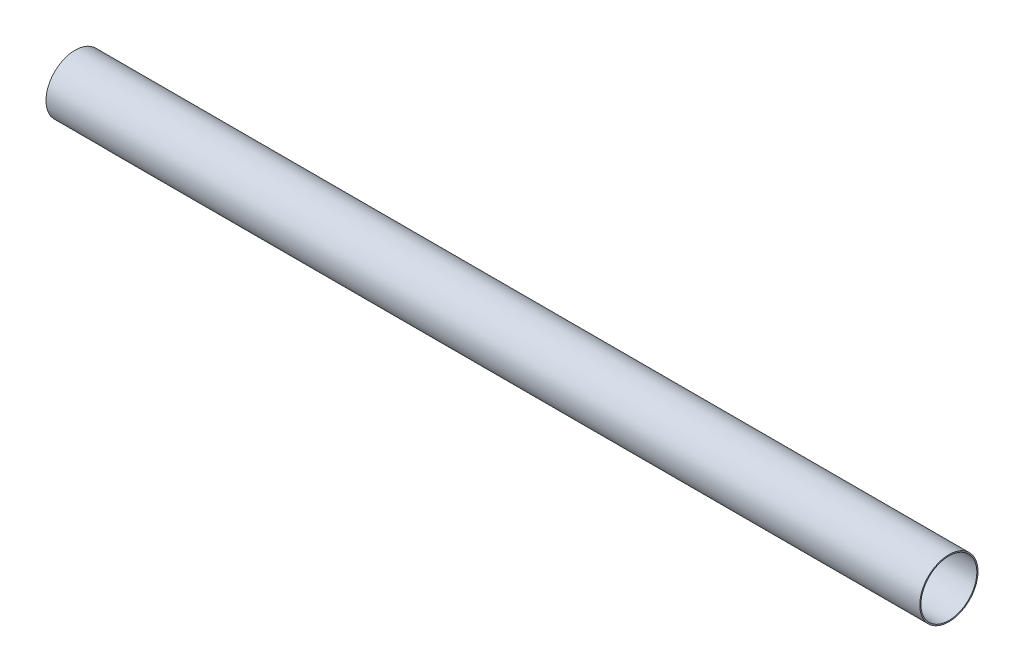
ISO-10303-21;
HEADER;
FILE_DESCRIPTION(('STEP AP214'),'2;1');
FILE_NAME('part.step','',(''),(''),'','','');
FILE_SCHEMA(('AUTOMOTIVE_DESIGN { 1 0 10303 214 1 1 1 1 }'));
ENDSEC;
DATA;
#1=APPLICATION_CONTEXT('core data for automotive mechanical design processes');
#2=APPLICATION_PROTOCOL_DEFINITION('international standard','automotive_design',2000,#1);
#3=PRODUCT_CONTEXT('',#1,'mechanical');
#4=PRODUCT('Part','Part','',(#3));
#5=PRODUCT_RELATED_PRODUCT_CATEGORY('part','',(#4));
#6=PRODUCT_DEFINITION_FORMATION('','',#4);
#7=PRODUCT_DEFINITION_CONTEXT('part definition',#1,'design');
#8=PRODUCT_DEFINITION('design','',#6,#7);
#9=PRODUCT_DEFINITION_SHAPE('','',#8);
#10=(LENGTH_UNIT() NAMED_UNIT(*) SI_UNIT(.MILLI.,.METRE.));
#11=(NAMED_UNIT(*) PLANE_ANGLE_UNIT() SI_UNIT($,.RADIAN.));
#12=(NAMED_UNIT(*) SI_UNIT($,.STERADIAN.) SOLID_ANGLE_UNIT());
#13=UNCERTAINTY_MEASURE_WITH_UNIT(LENGTH_MEASURE(1.E-05),#10,'distance_accuracy_value','');
#14=(GEOMETRIC_REPRESENTATION_CONTEXT(3) GLOBAL_UNCERTAINTY_ASSIGNED_CONTEXT((#13)) GLOBAL_UNIT_ASSIGNED_CONTEXT((#10,
#11,#12)) REPRESENTATION_CONTEXT('',''));
#15=CARTESIAN_POINT('',(0.,0.,0.));
#16=DIRECTION('',(0.,0.,1.));
#17=DIRECTION('',(1.,0.,0.));
#18=AXIS2_PLACEMENT_3D('',#15,#16,#17);
#19=CARTESIAN_POINT('',(900.,0.,0.));
#20=DIRECTION('',(-1.,0.,0.));
#21=DIRECTION('',(0.,0.,1.));
#22=AXIS2_PLACEMENT_3D('',#19,#20,#21);
#23=CYLINDRICAL_SURFACE('',#22,28.8);
#24=DIRECTION('',(-1.,0.,0.));
#25=VECTOR('',#24,1.);
#26=CARTESIAN_POINT('',(900.,-17.333205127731,23.));
#27=LINE('',#26,#25);
#28=CARTESIAN_POINT('',(50.,-17.333205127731,23.));
#29=VERTEX_POINT('',#28);
#30=CARTESIAN_POINT('',(0.,-17.333205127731,23.));
#31=VERTEX_POINT('',#30);
#32=EDGE_CURVE('E82',#29,#31,#27,.T.);
#33=ORIENTED_EDGE('',*,*,#32,.T.);
#34=CARTESIAN_POINT('',(0.,0.,0.));
#35=DIRECTION('',(-1.,0.,0.));
#36=DIRECTION('',(0.,1.,0.));
#37=AXIS2_PLACEMENT_3D('',#34,#35,#36);
#38=CIRCLE('',#37,28.8);
#39=CARTESIAN_POINT('',(0.,-17.333205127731,-23.));
#40=VERTEX_POINT('',#39);
#41=EDGE_CURVE('E76',#31,#40,#38,.T.);
#42=ORIENTED_EDGE('',*,*,#41,.T.);
#43=DIRECTION('',(-1.,0.,0.));
#44=VECTOR('',#43,1.);
#45=CARTESIAN_POINT('',(900.,-17.333205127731,-23.));
#46=LINE('',#45,#44);
#47=CARTESIAN_POINT('',(50.,-17.333205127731,-23.));
#48=VERTEX_POINT('',#47);
#49=EDGE_CURVE('E60',#40,#48,#46,.F.);
#50=ORIENTED_EDGE('',*,*,#49,.T.);
#51=CARTESIAN_POINT('',(50.,-17.333205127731,-23.));
#52=CARTESIAN_POINT('',(50.2186488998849,-17.3331927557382,-23.0000036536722));
#53=CARTESIAN_POINT('',(50.4372639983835,-17.3373443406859,-22.9968812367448));
#54=CARTESIAN_POINT('',(50.873981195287,-17.3538557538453,-22.9844262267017));
#55=CARTESIAN_POINT('',(51.0920833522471,-17.3662145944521,-22.9750943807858));
#56=CARTESIAN_POINT('',(51.7442027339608,-17.4153616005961,-22.9378937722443));
#57=CARTESIAN_POINT('',(52.1768684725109,-17.4642211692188,-22.9008195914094));
#58=CARTESIAN_POINT('',(53.0292346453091,-17.5909280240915,-22.8036278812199));
#59=CARTESIAN_POINT('',(53.4490309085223,-17.6683826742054,-22.7438221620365));
#60=CARTESIAN_POINT('',(54.2794171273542,-17.8490624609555,-22.6023032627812));
#61=CARTESIAN_POINT('',(54.6900024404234,-17.9523002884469,-22.5205792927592));
#62=CARTESIAN_POINT('',(55.6441570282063,-18.2213885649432,-22.3038215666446));
#63=CARTESIAN_POINT('',(56.183171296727,-18.3964545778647,-22.1601627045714));
#64=CARTESIAN_POINT('',(57.2392421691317,-18.7777459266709,-21.8380056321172));
#65=CARTESIAN_POINT('',(57.7562910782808,-18.9839820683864,-21.6594953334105));
#66=CARTESIAN_POINT('',(58.7714638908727,-19.4207920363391,-21.2687393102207));
#67=CARTESIAN_POINT('',(59.2694324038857,-19.6515241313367,-21.0562690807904));
#68=CARTESIAN_POINT('',(60.2428440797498,-20.1289853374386,-20.6003158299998));
#69=CARTESIAN_POINT('',(60.718287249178,-20.375714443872,-20.3568328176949));
#70=CARTESIAN_POINT('',(61.8125950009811,-20.9689474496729,-19.7479710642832));
#71=CARTESIAN_POINT('',(62.4222253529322,-21.3196875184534,-19.3700651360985));
#72=CARTESIAN_POINT('',(63.6013646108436,-22.027598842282,-18.5610931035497));
#73=CARTESIAN_POINT('',(64.1708593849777,-22.3847723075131,-18.1300084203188));
#74=CARTESIAN_POINT('',(65.267721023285,-23.0947837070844,-17.2164197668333));
#75=CARTESIAN_POINT('',(65.7951641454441,-23.4476284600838,-16.7340127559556));
#76=CARTESIAN_POINT('',(66.8067756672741,-24.140673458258,-15.7176978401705));
#77=CARTESIAN_POINT('',(67.2909583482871,-24.4808778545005,-15.1838070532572));
#78=CARTESIAN_POINT('',(68.1219845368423,-25.0754782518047,-14.1750720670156));
#79=CARTESIAN_POINT('',(68.4771206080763,-25.3336002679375,-13.7092376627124));
#80=CARTESIAN_POINT('',(69.1547513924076,-25.831991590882,-12.7452933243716));
#81=CARTESIAN_POINT('',(69.4772475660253,-26.0722616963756,-12.247184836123));
#82=CARTESIAN_POINT('',(70.0862836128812,-26.5303332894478,-11.2203885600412));
#83=CARTESIAN_POINT('',(70.3728618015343,-26.7481586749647,-10.6917342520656));
#84=CARTESIAN_POINT('',(70.9070709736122,-27.15724782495,-9.60523966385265));
#85=CARTESIAN_POINT('',(71.1547083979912,-27.348515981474,-9.04740423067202));
#86=CARTESIAN_POINT('',(71.5709354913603,-27.6718448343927,-7.99751135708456));
#87=CARTESIAN_POINT('',(71.7458326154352,-27.808479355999,-7.5093567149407));
#88=CARTESIAN_POINT('',(72.0636240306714,-28.0576865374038,-6.51674425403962));
#89=CARTESIAN_POINT('',(72.2065215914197,-28.1702616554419,-6.01228810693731));
#90=CARTESIAN_POINT('',(72.4583173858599,-28.3691745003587,-4.99008251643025));
#91=CARTESIAN_POINT('',(72.5672294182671,-28.4555228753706,-4.4723385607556));
#92=CARTESIAN_POINT('',(72.7494847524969,-28.6002794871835,-3.42673839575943));
#93=CARTESIAN_POINT('',(72.8228276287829,-28.6586873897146,-2.89888206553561));
#94=CARTESIAN_POINT('',(72.9329336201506,-28.746449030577,-1.83507144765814));
#95=CARTESIAN_POINT('',(72.9695678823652,-28.7757004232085,-1.2990952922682));
#96=CARTESIAN_POINT('',(73.0051736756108,-28.8041299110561,-0.225089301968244));
#97=CARTESIAN_POINT('',(73.0041451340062,-28.8033079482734,0.312940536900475));
#98=CARTESIAN_POINT('',(72.9644433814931,-28.7716095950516,1.38672705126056));
#99=CARTESIAN_POINT('',(72.9257690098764,-28.7407322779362,1.92248365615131));
#100=CARTESIAN_POINT('',(72.8114390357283,-28.6496170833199,2.98748581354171));
#101=CARTESIAN_POINT('',(72.7357842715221,-28.5893798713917,3.5167315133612));
#102=CARTESIAN_POINT('',(72.5538125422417,-28.4448867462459,4.53641966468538));
#103=CARTESIAN_POINT('',(72.4493784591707,-28.3621086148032,5.02741111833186));
#104=CARTESIAN_POINT('',(72.2099741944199,-28.1729935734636,5.99720772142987));
#105=CARTESIAN_POINT('',(72.075005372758,-28.0666577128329,6.47601341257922));
#106=CARTESIAN_POINT('',(71.7761686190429,-27.8322283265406,7.41911305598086));
#107=CARTESIAN_POINT('',(71.612295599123,-27.7041309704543,7.88340443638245));
#108=CARTESIAN_POINT('',(71.2574549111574,-27.4282144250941,8.79545916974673));
#109=CARTESIAN_POINT('',(71.0664856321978,-27.2803940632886,9.24322153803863));
#110=CARTESIAN_POINT('',(70.6395601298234,-26.9520140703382,10.1631675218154));
#111=CARTESIAN_POINT('',(70.4010390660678,-26.7696706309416,10.6335231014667));
#112=CARTESIAN_POINT('',(69.8958913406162,-26.3867269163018,11.5510976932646));
#113=CARTESIAN_POINT('',(69.6292631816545,-26.1861256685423,11.9983154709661));
#114=CARTESIAN_POINT('',(69.0699815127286,-25.769543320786,12.8687000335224));
#115=CARTESIAN_POINT('',(68.7773249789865,-25.5535604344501,13.2918640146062));
#116=CARTESIAN_POINT('',(68.1678339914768,-25.109096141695,14.1135228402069));
#117=CARTESIAN_POINT('',(67.8509962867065,-24.880613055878,14.5120143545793));
#118=CARTESIAN_POINT('',(67.127291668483,-24.3660959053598,15.3632297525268));
#119=CARTESIAN_POINT('',(66.7152984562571,-24.0778790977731,15.810284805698));
#120=CARTESIAN_POINT('',(65.860511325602,-23.4925253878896,16.6676556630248));
#121=CARTESIAN_POINT('',(65.4177124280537,-23.195387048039,17.0779655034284));
#122=CARTESIAN_POINT('',(64.5016892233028,-22.5968676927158,17.8624037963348));
#123=CARTESIAN_POINT('',(64.0283983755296,-22.2954786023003,18.2364483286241));
#124=CARTESIAN_POINT('',(63.0530078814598,-21.6950040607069,18.9468467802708));
#125=CARTESIAN_POINT('',(62.5509112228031,-21.3959183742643,19.283204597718));
#126=CARTESIAN_POINT('',(61.568859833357,-20.835842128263,19.8861740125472));
#127=CARTESIAN_POINT('',(61.0916033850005,-20.5740031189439,20.1563925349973));
#128=CARTESIAN_POINT('',(60.1133115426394,-20.0635216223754,20.6645773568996));
#129=CARTESIAN_POINT('',(59.6122752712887,-19.8148796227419,20.9025424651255));
#130=CARTESIAN_POINT('',(58.5892704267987,-19.3393826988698,21.3432117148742));
#131=CARTESIAN_POINT('',(58.0674527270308,-19.1124009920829,21.5461275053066));
#132=CARTESIAN_POINT('',(56.9999082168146,-18.6868763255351,21.9162083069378));
#133=CARTESIAN_POINT('',(56.454185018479,-18.4883290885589,22.0833786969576));
#134=CARTESIAN_POINT('',(55.4343182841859,-18.1598431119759,22.3539140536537));
#135=CARTESIAN_POINT('',(54.9636851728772,-18.0239799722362,22.4632889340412));
#136=CARTESIAN_POINT('',(54.0086472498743,-17.7847165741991,22.653196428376));
#137=CARTESIAN_POINT('',(53.5242524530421,-17.6812933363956,22.7337494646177));
#138=CARTESIAN_POINT('',(52.7859366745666,-17.5539523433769,22.8320308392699));
#139=CARTESIAN_POINT('',(52.535867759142,-17.5159520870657,22.8611705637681));
#140=CARTESIAN_POINT('',(52.0335474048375,-17.450311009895,22.9113151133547));
#141=CARTESIAN_POINT('',(51.7812960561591,-17.4226697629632,22.9323202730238));
#142=CARTESIAN_POINT('',(51.2746230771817,-17.3781727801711,22.9660605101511));
#143=CARTESIAN_POINT('',(51.0201974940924,-17.3613454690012,22.9787737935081));
#144=CARTESIAN_POINT('',(50.5105193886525,-17.3388432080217,22.9957507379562));
#145=CARTESIAN_POINT('',(50.2552666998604,-17.3331706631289,23.0000125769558));
#146=CARTESIAN_POINT('',(50.,-17.333205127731,23.));
#147=B_SPLINE_CURVE_WITH_KNOTS('',3,(#51,#52,#53,#54,#55,#56,#57,#58,#59,#60,#61,#62,#63,#64,
#65,#66,#67,#68,#69,#70,#71,#72,#73,#74,#75,#76,#77,#78,#79,#80,#81,#82,#83,#84,#85,#86,#87,#88,
#89,#90,#91,#92,#93,#94,#95,#96,#97,#98,#99,#100,#101,#102,#103,#104,#105,#106,#107,#108,#109,
#110,#111,#112,#113,#114,#115,#116,#117,#118,#119,#120,#121,#122,#123,#124,#125,#126,#127,#128,
#129,#130,#131,#132,#133,#134,#135,#136,#137,#138,#139,#140,#141,#142,#143,#144,#145,#146),
.UNSPECIFIED.,.F.,.F.,(4,2,2,2,2,2,2,2,2,2,2,2,2,2,2,2,2,2,2,2,2,2,2,2,2,2,2,2,2,2,2,2,2,2,2,2,
2,2,2,2,2,2,2,2,2,2,2,4),(0.,0.655819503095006,1.31156010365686,2.62054453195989,
3.91218617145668,5.20446483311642,6.9556678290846,8.70747931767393,10.4713911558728,
12.2353024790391,14.6274959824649,17.0205276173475,19.4091159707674,21.7969128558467,
23.7155436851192,25.6340886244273,27.5505692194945,29.4667324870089,31.073832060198,
32.6807673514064,34.2870493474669,35.8933505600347,37.5052705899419,39.1171937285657,
40.729166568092,42.3411028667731,43.8657243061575,45.3902778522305,46.9151000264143,
48.4400128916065,50.1124484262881,51.7849730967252,53.4576923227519,55.1306368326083,
57.1471450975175,59.1639800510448,61.1853759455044,63.2065625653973,65.0284572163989,
66.8504191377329,68.6609620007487,70.4712322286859,71.9752304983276,73.4781609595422,
74.2417067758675,75.0052211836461,75.7707343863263,76.5364126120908),.UNSPECIFIED.);
#148=EDGE_CURVE('E156',#48,#29,#147,.T.);
#149=ORIENTED_EDGE('',*,*,#148,.T.);
#150=EDGE_LOOP('',(#33,#42,#50,#149));
#151=FACE_BOUND('',#150,.T.);
#152=CARTESIAN_POINT('',(147.5,-28.1680670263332,-6.));
#153=CARTESIAN_POINT('',(147.333406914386,-28.1680650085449,-6.00000356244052));
#154=CARTESIAN_POINT('',(147.16685735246,-28.1695476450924,-5.99305998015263));
#155=CARTESIAN_POINT('',(146.834914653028,-28.1754295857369,-5.96534881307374));
#156=CARTESIAN_POINT('',(146.669521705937,-28.1798293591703,-5.94457900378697));
#157=CARTESIAN_POINT('',(146.341057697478,-28.1914203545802,-5.88936394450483));
#158=CARTESIAN_POINT('',(146.177987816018,-28.1986129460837,-5.8549119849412));
#159=CARTESIAN_POINT('',(145.855343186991,-28.2155796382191,-5.77259312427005));
#160=CARTESIAN_POINT('',(145.695769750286,-28.2253546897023,-5.72472128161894));
#161=CARTESIAN_POINT('',(145.381519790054,-28.2471842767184,-5.61601690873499));
#162=CARTESIAN_POINT('',(145.226836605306,-28.2592355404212,-5.55520296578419));
#163=CARTESIAN_POINT('',(144.923126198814,-28.2852855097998,-5.42100490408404));
#164=CARTESIAN_POINT('',(144.774101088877,-28.2992849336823,-5.34761614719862));
#165=CARTESIAN_POINT('',(144.482826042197,-28.3288254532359,-5.18884977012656));
#166=CARTESIAN_POINT('',(144.340573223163,-28.344365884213,-5.10347731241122));
#167=CARTESIAN_POINT('',(144.06365775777,-28.3765664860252,-4.9212835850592));
#168=CARTESIAN_POINT('',(143.928997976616,-28.3932270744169,-4.82445803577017));
#169=CARTESIAN_POINT('',(143.666454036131,-28.4274322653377,-4.6186703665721));
#170=CARTESIAN_POINT('',(143.53868486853,-28.4449857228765,-4.5095629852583));
#171=CARTESIAN_POINT('',(143.292710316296,-28.4802819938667,-4.2809941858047));
#172=CARTESIAN_POINT('',(143.174508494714,-28.4980248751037,-4.16152894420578));
#173=CARTESIAN_POINT('',(142.94855085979,-28.5331953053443,-3.91311809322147));
#174=CARTESIAN_POINT('',(142.840792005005,-28.5506229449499,-3.78417526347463));
#175=CARTESIAN_POINT('',(142.636382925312,-28.5846918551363,-3.51759183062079));
#176=CARTESIAN_POINT('',(142.539736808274,-28.6013328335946,-3.37994804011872));
#177=CARTESIAN_POINT('',(142.357448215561,-28.6335068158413,-3.09563161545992));
#178=CARTESIAN_POINT('',(142.271914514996,-28.6490282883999,-2.94888789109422));
#179=CARTESIAN_POINT('',(142.113502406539,-28.6783593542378,-2.64848882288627));
#180=CARTESIAN_POINT('',(142.040628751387,-28.6921683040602,-2.49483091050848));
#181=CARTESIAN_POINT('',(141.908162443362,-28.7176672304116,-2.18179008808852));
#182=CARTESIAN_POINT('',(141.84856382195,-28.7293581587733,-2.02240978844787));
#183=CARTESIAN_POINT('',(141.743059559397,-28.7502996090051,-1.6990070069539));
#184=CARTESIAN_POINT('',(141.697158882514,-28.7595492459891,-1.53498286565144));
#185=CARTESIAN_POINT('',(141.581782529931,-28.7829702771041,-1.04257340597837));
#186=CARTESIAN_POINT('',(141.53258084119,-28.7932219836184,-0.70897950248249));
#187=CARTESIAN_POINT('',(141.490710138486,-28.8019302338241,-0.0383096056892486));
#188=CARTESIAN_POINT('',(141.498035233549,-28.8003880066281,0.298766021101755));
#189=CARTESIAN_POINT('',(141.568330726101,-28.785822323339,0.961554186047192));
#190=CARTESIAN_POINT('',(141.630439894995,-28.7729765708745,1.28736181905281));
#191=CARTESIAN_POINT('',(141.807192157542,-28.7374429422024,1.9238135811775));
#192=CARTESIAN_POINT('',(141.921837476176,-28.7147546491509,2.2344570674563));
#193=CARTESIAN_POINT('',(142.201184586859,-28.6617967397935,2.8342070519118));
#194=CARTESIAN_POINT('',(142.366219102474,-28.6314769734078,3.12315398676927));
#195=CARTESIAN_POINT('',(142.741414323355,-28.5665904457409,3.66956885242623));
#196=CARTESIAN_POINT('',(142.95158063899,-28.5320231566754,3.9270328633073));
#197=CARTESIAN_POINT('',(143.415783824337,-28.4616816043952,4.40829210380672));
#198=CARTESIAN_POINT('',(143.670574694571,-28.4258968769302,4.63135912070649));
#199=CARTESIAN_POINT('',(144.214313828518,-28.3577698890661,5.03172468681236));
#200=CARTESIAN_POINT('',(144.50326285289,-28.3254277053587,5.20902221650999));
#201=CARTESIAN_POINT('',(145.108218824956,-28.2678239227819,5.51309841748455));
#202=CARTESIAN_POINT('',(145.424291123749,-28.2425800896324,5.63975066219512));
#203=CARTESIAN_POINT('',(146.073879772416,-28.2022851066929,5.83793172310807));
#204=CARTESIAN_POINT('',(146.407393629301,-28.1872325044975,5.90946839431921));
#205=CARTESIAN_POINT('',(147.075774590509,-28.1693175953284,5.99428146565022));
#206=CARTESIAN_POINT('',(147.410502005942,-28.1662344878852,6.00861326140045));
#207=CARTESIAN_POINT('',(148.077563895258,-28.1720136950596,5.98145728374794));
#208=CARTESIAN_POINT('',(148.409898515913,-28.1808752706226,5.93997296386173));
#209=CARTESIAN_POINT('',(149.059138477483,-28.2093378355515,5.80327480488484));
#210=CARTESIAN_POINT('',(149.376169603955,-28.2288245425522,5.70863240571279));
#211=CARTESIAN_POINT('',(149.989875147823,-28.2762402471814,5.46891890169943));
#212=CARTESIAN_POINT('',(150.286547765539,-28.3041699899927,5.32384334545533));
#213=CARTESIAN_POINT('',(150.855710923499,-28.3658160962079,4.98502078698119));
#214=CARTESIAN_POINT('',(151.127802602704,-28.3996083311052,4.7906178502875));
#215=CARTESIAN_POINT('',(151.635887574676,-28.4689672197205,4.35952503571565));
#216=CARTESIAN_POINT('',(151.871876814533,-28.504534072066,4.12283041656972));
#217=CARTESIAN_POINT('',(152.305101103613,-28.5741564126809,3.60912322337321));
#218=CARTESIAN_POINT('',(152.501619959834,-28.6081765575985,3.33150114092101));
#219=CARTESIAN_POINT('',(152.845225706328,-28.6702418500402,2.74655650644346));
#220=CARTESIAN_POINT('',(152.992314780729,-28.6982872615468,2.43923526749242));
#221=CARTESIAN_POINT('',(153.231866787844,-28.7450957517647,1.80549695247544));
#222=CARTESIAN_POINT('',(153.324656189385,-28.7639141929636,1.47920724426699));
#223=CARTESIAN_POINT('',(153.453984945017,-28.7903765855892,0.815049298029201));
#224=CARTESIAN_POINT('',(153.490531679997,-28.7980220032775,0.477182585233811));
#225=CARTESIAN_POINT('',(153.502249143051,-28.800471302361,-0.0270973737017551));
#226=CARTESIAN_POINT('',(153.499189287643,-28.7998302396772,-0.193262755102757));
#227=CARTESIAN_POINT('',(153.479312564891,-28.7956948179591,-0.524715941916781));
#228=CARTESIAN_POINT('',(153.462500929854,-28.7922015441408,-0.690004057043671));
#229=CARTESIAN_POINT('',(153.415240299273,-28.7824520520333,-1.01858112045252));
#230=CARTESIAN_POINT('',(153.384786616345,-28.7761948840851,-1.18186936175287));
#231=CARTESIAN_POINT('',(153.310498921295,-28.7610947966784,-1.50519152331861));
#232=CARTESIAN_POINT('',(153.266669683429,-28.7522527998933,-1.6652265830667));
#233=CARTESIAN_POINT('',(153.16608297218,-28.7322480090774,-1.9806158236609));
#234=CARTESIAN_POINT('',(153.109355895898,-28.7210906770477,-2.13598005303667));
#235=CARTESIAN_POINT('',(152.983363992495,-28.6967500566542,-2.44130795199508));
#236=CARTESIAN_POINT('',(152.914103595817,-28.6835674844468,-2.59127350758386));
#237=CARTESIAN_POINT('',(152.763501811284,-28.6555226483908,-2.88492433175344));
#238=CARTESIAN_POINT('',(152.682155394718,-28.6406596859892,-3.02860695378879));
#239=CARTESIAN_POINT('',(152.508004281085,-28.60966218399,-3.30863580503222));
#240=CARTESIAN_POINT('',(152.415203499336,-28.593528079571,-3.44498451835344));
#241=CARTESIAN_POINT('',(152.217006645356,-28.5601198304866,-3.71186788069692));
#242=CARTESIAN_POINT('',(152.111416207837,-28.5428305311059,-3.8422563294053));
#243=CARTESIAN_POINT('',(151.889760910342,-28.5078591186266,-4.09366267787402));
#244=CARTESIAN_POINT('',(151.773699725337,-28.4901771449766,-4.21468383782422));
#245=CARTESIAN_POINT('',(151.531779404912,-28.4548927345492,-4.44666804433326));
#246=CARTESIAN_POINT('',(151.405914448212,-28.4372903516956,-4.55762502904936));
#247=CARTESIAN_POINT('',(151.145335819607,-28.4026725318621,-4.76860783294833));
#248=CARTESIAN_POINT('',(151.010625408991,-28.3856568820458,-4.86863764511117));
#249=CARTESIAN_POINT('',(150.731504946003,-28.352481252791,-5.05827942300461));
#250=CARTESIAN_POINT('',(150.586996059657,-28.3363343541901,-5.14774829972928));
#251=CARTESIAN_POINT('',(150.290838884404,-28.305601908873,-5.3141375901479));
#252=CARTESIAN_POINT('',(150.139193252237,-28.2910157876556,-5.39106262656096));
#253=CARTESIAN_POINT('',(149.829854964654,-28.2638375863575,-5.53178314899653));
#254=CARTESIAN_POINT('',(149.672165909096,-28.2512443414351,-5.59558631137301));
#255=CARTESIAN_POINT('',(149.351839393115,-28.2284211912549,-5.70960635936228));
#256=CARTESIAN_POINT('',(149.189202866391,-28.2181908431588,-5.75982579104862));
#257=CARTESIAN_POINT('',(148.776406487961,-28.1958851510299,-5.86826926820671));
#258=CARTESIAN_POINT('',(148.523758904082,-28.1855130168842,-5.91759790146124));
#259=CARTESIAN_POINT('',(148.014039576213,-28.1716056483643,-5.98345985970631));
#260=CARTESIAN_POINT('',(147.756968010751,-28.1680701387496,-5.99999450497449));
#261=CARTESIAN_POINT('',(147.5,-28.1680670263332,-6.));
#262=B_SPLINE_CURVE_WITH_KNOTS('',3,(#152,#153,#154,#155,#156,#157,#158,#159,#160,#161,#162,
#163,#164,#165,#166,#167,#168,#169,#170,#171,#172,#173,#174,#175,#176,#177,#178,#179,#180,#181,
#182,#183,#184,#185,#186,#187,#188,#189,#190,#191,#192,#193,#194,#195,#196,#197,#198,#199,#200,
#201,#202,#203,#204,#205,#206,#207,#208,#209,#210,#211,#212,#213,#214,#215,#216,#217,#218,#219,
#220,#221,#222,#223,#224,#225,#226,#227,#228,#229,#230,#231,#232,#233,#234,#235,#236,#237,#238,
#239,#240,#241,#242,#243,#244,#245,#246,#247,#248,#249,#250,#251,#252,#253,#254,#255,#256,#257,
#258,#259,#260,#261),.UNSPECIFIED.,.T.,.F.,(4,2,2,2,2,2,2,2,2,2,2,2,2,2,2,2,2,2,2,2,2,2,2,2,2,2,
2,2,2,2,2,2,2,2,2,2,2,2,2,2,2,2,2,2,2,2,2,2,2,2,2,2,2,2,4),(0.,0.499553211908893,
0.999186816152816,1.49906573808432,1.99912897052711,2.49847880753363,2.99801322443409,
3.49733310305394,3.99684015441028,4.50304150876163,5.00943052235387,5.51567160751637,
6.0220992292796,6.53316067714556,7.04441357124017,7.55543613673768,8.06664367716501,
9.07336153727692,10.0799744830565,11.0710395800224,12.062146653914,13.0599450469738,
14.0578675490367,15.0746485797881,16.0914522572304,17.1107785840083,18.1299596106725,
19.1302479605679,20.1304744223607,21.1201489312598,22.109910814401,23.1135952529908,
24.1173922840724,25.138021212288,26.1586050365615,27.1729879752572,28.1872377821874,
28.685335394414,29.1832435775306,29.6813229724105,30.1792247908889,30.6759651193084,
31.1725301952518,31.6693024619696,32.1659053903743,32.6713249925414,33.1765678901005,
33.6821131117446,34.187472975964,34.6990415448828,35.2104211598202,35.7215007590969,
36.2324844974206,37.0030708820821,37.7736262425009),.UNSPECIFIED.);
#263=CARTESIAN_POINT('',(147.5,-28.1680670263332,-6.));
#264=VERTEX_POINT('',#263);
#265=EDGE_CURVE('E151',#264,#264,#262,.T.);
#266=ORIENTED_EDGE('',*,*,#265,.F.);
#267=EDGE_LOOP('',(#266));
#268=FACE_BOUND('',#267,.T.);
#269=CARTESIAN_POINT('',(87.5,-28.1680670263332,-6.));
#270=CARTESIAN_POINT('',(87.3334069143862,-28.1680650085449,-6.00000356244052));
#271=CARTESIAN_POINT('',(87.1668573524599,-28.1695476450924,-5.99305998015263));
#272=CARTESIAN_POINT('',(86.8349146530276,-28.1754295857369,-5.96534881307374));
#273=CARTESIAN_POINT('',(86.6695217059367,-28.1798293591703,-5.94457900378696));
#274=CARTESIAN_POINT('',(86.3410576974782,-28.1914203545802,-5.88936394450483));
#275=CARTESIAN_POINT('',(86.1779878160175,-28.1986129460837,-5.8549119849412));
#276=CARTESIAN_POINT('',(85.8553431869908,-28.2155796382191,-5.77259312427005));
#277=CARTESIAN_POINT('',(85.6957697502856,-28.2253546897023,-5.72472128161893));
#278=CARTESIAN_POINT('',(85.3815197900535,-28.2471842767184,-5.61601690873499));
#279=CARTESIAN_POINT('',(85.2268366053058,-28.2592355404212,-5.55520296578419));
#280=CARTESIAN_POINT('',(84.9231261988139,-28.2852855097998,-5.42100490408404));
#281=CARTESIAN_POINT('',(84.7741010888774,-28.2992849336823,-5.34761614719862));
#282=CARTESIAN_POINT('',(84.4828260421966,-28.3288254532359,-5.18884977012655));
#283=CARTESIAN_POINT('',(84.3405732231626,-28.344365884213,-5.10347731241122));
#284=CARTESIAN_POINT('',(84.0636577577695,-28.3765664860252,-4.9212835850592));
#285=CARTESIAN_POINT('',(83.9289979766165,-28.3932270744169,-4.82445803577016));
#286=CARTESIAN_POINT('',(83.6664540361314,-28.4274322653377,-4.6186703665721));
#287=CARTESIAN_POINT('',(83.5386848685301,-28.4449857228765,-4.50956298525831));
#288=CARTESIAN_POINT('',(83.2927103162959,-28.4802819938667,-4.28099418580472));
#289=CARTESIAN_POINT('',(83.1745084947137,-28.4980248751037,-4.16152894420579));
#290=CARTESIAN_POINT('',(82.9485508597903,-28.5331953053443,-3.91311809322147));
#291=CARTESIAN_POINT('',(82.8407920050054,-28.5506229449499,-3.78417526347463));
#292=CARTESIAN_POINT('',(82.6363829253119,-28.5846918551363,-3.51759183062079));
#293=CARTESIAN_POINT('',(82.5397368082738,-28.6013328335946,-3.37994804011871));
#294=CARTESIAN_POINT('',(82.3574482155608,-28.6335068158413,-3.09563161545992));
#295=CARTESIAN_POINT('',(82.271914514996,-28.6490282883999,-2.94888789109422));
#296=CARTESIAN_POINT('',(82.1135024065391,-28.6783593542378,-2.64848882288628));
#297=CARTESIAN_POINT('',(82.0406287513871,-28.6921683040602,-2.49483091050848));
#298=CARTESIAN_POINT('',(81.9081624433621,-28.7176672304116,-2.18179008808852));
#299=CARTESIAN_POINT('',(81.8485638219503,-28.7293581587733,-2.02240978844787));
#300=CARTESIAN_POINT('',(81.7430595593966,-28.7502996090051,-1.6990070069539));
#301=CARTESIAN_POINT('',(81.6971588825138,-28.7595492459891,-1.53498286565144));
#302=CARTESIAN_POINT('',(81.5817825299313,-28.7829702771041,-1.04257340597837));
#303=CARTESIAN_POINT('',(81.5325808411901,-28.7932219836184,-0.70897950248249));
#304=CARTESIAN_POINT('',(81.4907101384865,-28.8019302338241,-0.038309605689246));
#305=CARTESIAN_POINT('',(81.4980352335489,-28.8003880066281,0.298766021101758));
#306=CARTESIAN_POINT('',(81.5683307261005,-28.785822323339,0.961554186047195));
#307=CARTESIAN_POINT('',(81.630439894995,-28.7729765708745,1.28736181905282));
#308=CARTESIAN_POINT('',(81.8071921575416,-28.7374429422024,1.9238135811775));
#309=CARTESIAN_POINT('',(81.921837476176,-28.7147546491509,2.23445706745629));
#310=CARTESIAN_POINT('',(82.2011845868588,-28.6617967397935,2.8342070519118));
#311=CARTESIAN_POINT('',(82.3662191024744,-28.6314769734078,3.12315398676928));
#312=CARTESIAN_POINT('',(82.7414143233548,-28.5665904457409,3.66956885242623));
#313=CARTESIAN_POINT('',(82.9515806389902,-28.5320231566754,3.9270328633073));
#314=CARTESIAN_POINT('',(83.4157838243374,-28.4616816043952,4.40829210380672));
#315=CARTESIAN_POINT('',(83.6705746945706,-28.4258968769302,4.6313591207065));
#316=CARTESIAN_POINT('',(84.2143138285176,-28.3577698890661,5.03172468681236));
#317=CARTESIAN_POINT('',(84.5032628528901,-28.3254277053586,5.20902221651));
#318=CARTESIAN_POINT('',(85.1082188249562,-28.2678239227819,5.51309841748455));
#319=CARTESIAN_POINT('',(85.4242911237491,-28.2425800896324,5.63975066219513));
#320=CARTESIAN_POINT('',(86.0738797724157,-28.2022851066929,5.83793172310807));
#321=CARTESIAN_POINT('',(86.4073936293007,-28.1872325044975,5.90946839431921));
#322=CARTESIAN_POINT('',(87.0757745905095,-28.1693175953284,5.99428146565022));
#323=CARTESIAN_POINT('',(87.4105020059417,-28.1662344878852,6.00861326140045));
#324=CARTESIAN_POINT('',(88.077563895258,-28.1720136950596,5.98145728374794));
#325=CARTESIAN_POINT('',(88.4098985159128,-28.1808752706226,5.93997296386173));
#326=CARTESIAN_POINT('',(89.0591384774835,-28.2093378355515,5.80327480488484));
#327=CARTESIAN_POINT('',(89.3761696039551,-28.2288245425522,5.70863240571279));
#328=CARTESIAN_POINT('',(89.9898751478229,-28.2762402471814,5.46891890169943));
#329=CARTESIAN_POINT('',(90.286547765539,-28.3041699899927,5.32384334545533));
#330=CARTESIAN_POINT('',(90.8557109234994,-28.3658160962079,4.98502078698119));
#331=CARTESIAN_POINT('',(91.1278026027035,-28.3996083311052,4.79061785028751));
#332=CARTESIAN_POINT('',(91.635887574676,-28.4689672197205,4.35952503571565));
#333=CARTESIAN_POINT('',(91.8718768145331,-28.504534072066,4.12283041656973));
#334=CARTESIAN_POINT('',(92.3051011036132,-28.5741564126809,3.60912322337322));
#335=CARTESIAN_POINT('',(92.5016199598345,-28.6081765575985,3.33150114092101));
#336=CARTESIAN_POINT('',(92.8452257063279,-28.6702418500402,2.74655650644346));
#337=CARTESIAN_POINT('',(92.9923147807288,-28.6982872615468,2.43923526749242));
#338=CARTESIAN_POINT('',(93.2318667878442,-28.7450957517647,1.80549695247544));
#339=CARTESIAN_POINT('',(93.324656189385,-28.7639141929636,1.47920724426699));
#340=CARTESIAN_POINT('',(93.4539849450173,-28.7903765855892,0.815049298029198));
#341=CARTESIAN_POINT('',(93.4905316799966,-28.7980220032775,0.477182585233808));
#342=CARTESIAN_POINT('',(93.5022491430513,-28.800471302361,-0.0270973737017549));
#343=CARTESIAN_POINT('',(93.4991892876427,-28.7998302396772,-0.193262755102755));
#344=CARTESIAN_POINT('',(93.4793125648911,-28.7956948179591,-0.524715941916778));
#345=CARTESIAN_POINT('',(93.4625009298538,-28.7922015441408,-0.69000405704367));
#346=CARTESIAN_POINT('',(93.4152402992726,-28.7824520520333,-1.01858112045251));
#347=CARTESIAN_POINT('',(93.3847866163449,-28.7761948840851,-1.18186936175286));
#348=CARTESIAN_POINT('',(93.3104989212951,-28.7610947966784,-1.50519152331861));
#349=CARTESIAN_POINT('',(93.2666696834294,-28.7522527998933,-1.6652265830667));
#350=CARTESIAN_POINT('',(93.1660829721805,-28.7322480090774,-1.98061582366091));
#351=CARTESIAN_POINT('',(93.1093558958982,-28.7210906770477,-2.13598005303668));
#352=CARTESIAN_POINT('',(92.9833639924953,-28.6967500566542,-2.44130795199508));
#353=CARTESIAN_POINT('',(92.9141035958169,-28.6835674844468,-2.59127350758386));
#354=CARTESIAN_POINT('',(92.7635018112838,-28.6555226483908,-2.88492433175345));
#355=CARTESIAN_POINT('',(92.6821553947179,-28.6406596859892,-3.02860695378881));
#356=CARTESIAN_POINT('',(92.5080042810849,-28.60966218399,-3.30863580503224));
#357=CARTESIAN_POINT('',(92.415203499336,-28.593528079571,-3.44498451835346));
#358=CARTESIAN_POINT('',(92.2170066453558,-28.5601198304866,-3.71186788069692));
#359=CARTESIAN_POINT('',(92.1114162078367,-28.5428305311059,-3.8422563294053));
#360=CARTESIAN_POINT('',(91.889760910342,-28.5078591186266,-4.09366267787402));
#361=CARTESIAN_POINT('',(91.7736997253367,-28.4901771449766,-4.21468383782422));
#362=CARTESIAN_POINT('',(91.5317794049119,-28.4548927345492,-4.44666804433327));
#363=CARTESIAN_POINT('',(91.4059144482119,-28.4372903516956,-4.55762502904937));
#364=CARTESIAN_POINT('',(91.1453358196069,-28.4026725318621,-4.76860783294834));
#365=CARTESIAN_POINT('',(91.0106254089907,-28.3856568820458,-4.86863764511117));
#366=CARTESIAN_POINT('',(90.7315049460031,-28.352481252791,-5.05827942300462));
#367=CARTESIAN_POINT('',(90.5869960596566,-28.3363343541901,-5.14774829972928));
#368=CARTESIAN_POINT('',(90.2908388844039,-28.305601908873,-5.3141375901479));
#369=CARTESIAN_POINT('',(90.1391932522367,-28.2910157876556,-5.39106262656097));
#370=CARTESIAN_POINT('',(89.8298549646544,-28.2638375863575,-5.53178314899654));
#371=CARTESIAN_POINT('',(89.6721659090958,-28.2512443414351,-5.59558631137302));
#372=CARTESIAN_POINT('',(89.3518393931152,-28.2284211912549,-5.70960635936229));
#373=CARTESIAN_POINT('',(89.1892028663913,-28.2181908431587,-5.75982579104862));
#374=CARTESIAN_POINT('',(88.7764064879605,-28.1958851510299,-5.8682692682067));
#375=CARTESIAN_POINT('',(88.5237589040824,-28.1855130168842,-5.91759790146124));
#376=CARTESIAN_POINT('',(88.0140395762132,-28.1716056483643,-5.98345985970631));
#377=CARTESIAN_POINT('',(87.7569680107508,-28.1680701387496,-5.99999450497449));
#378=CARTESIAN_POINT('',(87.5,-28.1680670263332,-6.));
#379=B_SPLINE_CURVE_WITH_KNOTS('',3,(#269,#270,#271,#272,#273,#274,#275,#276,#277,#278,#279,
#280,#281,#282,#283,#284,#285,#286,#287,#288,#289,#290,#291,#292,#293,#294,#295,#296,#297,#298,
#299,#300,#301,#302,#303,#304,#305,#306,#307,#308,#309,#310,#311,#312,#313,#314,#315,#316,#317,
#318,#319,#320,#321,#322,#323,#324,#325,#326,#327,#328,#329,#330,#331,#332,#333,#334,#335,#336,
#337,#338,#339,#340,#341,#342,#343,#344,#345,#346,#347,#348,#349,#350,#351,#352,#353,#354,#355,
#356,#357,#358,#359,#360,#361,#362,#363,#364,#365,#366,#367,#368,#369,#370,#371,#372,#373,#374,
#375,#376,#377,#378),.UNSPECIFIED.,.T.,.F.,(4,2,2,2,2,2,2,2,2,2,2,2,2,2,2,2,2,2,2,2,2,2,2,2,2,2,
2,2,2,2,2,2,2,2,2,2,2,2,2,2,2,2,2,2,2,2,2,2,2,2,2,2,2,2,4),(0.,0.499553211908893,
0.999186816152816,1.49906573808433,1.99912897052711,2.49847880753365,2.99801322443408,
3.49733310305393,3.99684015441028,4.5030415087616,5.00943052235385,5.51567160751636,
6.0220992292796,6.53316067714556,7.04441357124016,7.55543613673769,8.06664367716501,
9.07336153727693,10.0799744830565,11.0710395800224,12.062146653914,13.0599450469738,
14.0578675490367,15.0746485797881,16.0914522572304,17.1107785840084,18.1299596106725,
19.130247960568,20.1304744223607,21.1201489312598,22.109910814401,23.1135952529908,
24.1173922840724,25.138021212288,26.1586050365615,27.1729879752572,28.1872377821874,
28.685335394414,29.1832435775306,29.6813229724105,30.1792247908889,30.6759651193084,
31.1725301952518,31.6693024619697,32.1659053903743,32.6713249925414,33.1765678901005,
33.6821131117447,34.187472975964,34.6990415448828,35.2104211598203,35.7215007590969,
36.2324844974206,37.0030708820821,37.7736262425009),.UNSPECIFIED.);
#380=CARTESIAN_POINT('',(87.5,-28.1680670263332,-6.));
#381=VERTEX_POINT('',#380);
#382=EDGE_CURVE('E92',#381,#381,#379,.T.);
#383=ORIENTED_EDGE('',*,*,#382,.F.);
#384=EDGE_LOOP('',(#383));
#385=FACE_BOUND('',#384,.T.);
#386=CARTESIAN_POINT('',(900.,0.,0.));
#387=DIRECTION('',(-1.,0.,0.));
#388=DIRECTION('',(0.,1.,0.));
#389=AXIS2_PLACEMENT_3D('',#386,#387,#388);
#390=CIRCLE('',#389,28.8);
#391=CARTESIAN_POINT('',(900.,28.8,0.));
#392=VERTEX_POINT('',#391);
#393=EDGE_CURVE('E90',#392,#392,#390,.T.);
#394=ORIENTED_EDGE('',*,*,#393,.F.);
#395=EDGE_LOOP('',(#394));
#396=FACE_BOUND('',#395,.T.);
#397=ADVANCED_FACE('F14',(#151,#268,#385,#396),#23,.F.);
#398=CARTESIAN_POINT('',(900.,0.,0.));
#399=DIRECTION('',(-1.,0.,0.));
#400=DIRECTION('',(0.,0.,1.));
#401=AXIS2_PLACEMENT_3D('',#398,#399,#400);
#402=CYLINDRICAL_SURFACE('',#401,30.);
#403=CARTESIAN_POINT('',(0.,0.,0.));
#404=DIRECTION('',(-1.,0.,0.));
#405=DIRECTION('',(0.,1.,0.));
#406=AXIS2_PLACEMENT_3D('',#403,#404,#405);
#407=CIRCLE('',#406,30.);
#408=CARTESIAN_POINT('',(0.,-19.2613602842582,23.));
#409=VERTEX_POINT('',#408);
#410=CARTESIAN_POINT('',(0.,-19.2613602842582,-23.));
#411=VERTEX_POINT('',#410);
#412=EDGE_CURVE('E40',#409,#411,#407,.T.);
#413=ORIENTED_EDGE('',*,*,#412,.F.);
#414=DIRECTION('',(-1.,0.,0.));
#415=VECTOR('',#414,1.);
#416=CARTESIAN_POINT('',(900.,-19.2613602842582,23.));
#417=LINE('',#416,#415);
#418=CARTESIAN_POINT('',(50.,-19.2613602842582,23.));
#419=VERTEX_POINT('',#418);
#420=EDGE_CURVE('E70',#419,#409,#417,.T.);
#421=ORIENTED_EDGE('',*,*,#420,.F.);
#422=CARTESIAN_POINT('',(50.,-19.2613602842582,-23.));
#423=CARTESIAN_POINT('',(50.2685918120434,-19.2613276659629,-23.0000128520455));
#424=CARTESIAN_POINT('',(50.5371703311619,-19.2669775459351,-22.995295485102));
#425=CARTESIAN_POINT('',(51.0734848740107,-19.2893994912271,-22.9764979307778));
#426=CARTESIAN_POINT('',(51.3412210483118,-19.3061694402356,-22.9624195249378));
#427=CARTESIAN_POINT('',(51.8745028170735,-19.3505360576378,-22.9250419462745));
#428=CARTESIAN_POINT('',(52.1400521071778,-19.3781068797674,-22.9017647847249));
#429=CARTESIAN_POINT('',(52.6688984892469,-19.4436139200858,-22.8461749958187));
#430=CARTESIAN_POINT('',(52.9321954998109,-19.4815505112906,-22.813862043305));
#431=CARTESIAN_POINT('',(53.7102199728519,-19.6088470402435,-22.7047491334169));
#432=CARTESIAN_POINT('',(54.2209469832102,-19.7123800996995,-22.615210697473));
#433=CARTESIAN_POINT('',(55.2279100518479,-19.9522250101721,-22.4038863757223));
#434=CARTESIAN_POINT('',(55.7241363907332,-20.0885583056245,-22.2820793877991));
#435=CARTESIAN_POINT('',(56.8070561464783,-20.4209512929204,-21.9783044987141));
#436=CARTESIAN_POINT('',(57.3896793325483,-20.6235523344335,-21.7889989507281));
#437=CARTESIAN_POINT('',(58.5282385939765,-21.0583395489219,-21.3690812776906));
#438=CARTESIAN_POINT('',(59.0841691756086,-21.2905317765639,-21.1384606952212));
#439=CARTESIAN_POINT('',(60.1720195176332,-21.7768665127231,-20.6371207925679));
#440=CARTESIAN_POINT('',(60.703782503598,-22.031127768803,-20.3661781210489));
#441=CARTESIAN_POINT('',(61.7398013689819,-22.5526636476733,-19.7870974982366));
#442=CARTESIAN_POINT('',(62.2440592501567,-22.8199373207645,-19.4789622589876));
#443=CARTESIAN_POINT('',(63.2363767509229,-23.3672094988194,-18.8191782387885));
#444=CARTESIAN_POINT('',(63.723793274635,-23.647359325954,-18.4666888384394));
#445=CARTESIAN_POINT('',(64.6693393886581,-24.2083611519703,-17.7248850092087));
#446=CARTESIAN_POINT('',(65.1274680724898,-24.4892131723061,-17.3355694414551));
#447=CARTESIAN_POINT('',(66.0126172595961,-25.0456726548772,-16.5214104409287));
#448=CARTESIAN_POINT('',(66.4396914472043,-25.3212885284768,-16.0966311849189));
#449=CARTESIAN_POINT('',(67.2619857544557,-25.862723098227,-15.2114660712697));
#450=CARTESIAN_POINT('',(67.6572077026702,-26.1285423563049,-14.7510822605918));
#451=CARTESIAN_POINT('',(68.397561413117,-26.6345719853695,-13.8155817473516));
#452=CARTESIAN_POINT('',(68.7441052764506,-26.8753900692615,-13.3419134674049));
#453=CARTESIAN_POINT('',(69.4034818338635,-27.3393533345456,-12.3633699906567));
#454=CARTESIAN_POINT('',(69.716314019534,-27.5624982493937,-11.8584943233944));
#455=CARTESIAN_POINT('',(70.3052090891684,-27.986779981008,-10.8191970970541));
#456=CARTESIAN_POINT('',(70.581288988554,-28.187926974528,-10.2847893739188));
#457=CARTESIAN_POINT('',(71.0935928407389,-28.5641282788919,-9.18837740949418));
#458=CARTESIAN_POINT('',(71.3298234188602,-28.7391869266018,-8.62637777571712));
#459=CARTESIAN_POINT('',(71.7268850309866,-29.0351990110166,-7.56399870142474));
#460=CARTESIAN_POINT('',(71.8937106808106,-29.1603293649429,-7.06701821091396));
#461=CARTESIAN_POINT('',(72.1941546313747,-29.3865737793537,-6.05777253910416));
#462=CARTESIAN_POINT('',(72.3277760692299,-29.4876901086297,-5.54550880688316));
#463=CARTESIAN_POINT('',(72.5599478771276,-29.6638758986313,-4.50895483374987));
#464=CARTESIAN_POINT('',(72.658516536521,-29.7389589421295,-3.98467101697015));
#465=CARTESIAN_POINT('',(72.8192165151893,-29.8615796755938,-2.9273327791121));
#466=CARTESIAN_POINT('',(72.8813474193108,-29.9091170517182,-2.39427825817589));
#467=CARTESIAN_POINT('',(72.9683059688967,-29.9756950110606,-1.32180657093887));
#468=CARTESIAN_POINT('',(72.9930262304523,-29.9946535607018,-0.782375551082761));
#469=CARTESIAN_POINT('',(73.0044142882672,-30.0033841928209,0.297127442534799));
#470=CARTESIAN_POINT('',(72.99108200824,-29.9931562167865,0.837199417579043));
#471=CARTESIAN_POINT('',(72.9265834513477,-29.9437439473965,1.91380017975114));
#472=CARTESIAN_POINT('',(72.875412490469,-29.9045560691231,2.45032851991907));
#473=CARTESIAN_POINT('',(72.7360597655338,-29.798093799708,3.51570857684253));
#474=CARTESIAN_POINT('',(72.64787848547,-29.7308197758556,4.04456039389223));
#475=CARTESIAN_POINT('',(72.4403189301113,-29.5730210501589,5.06888855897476));
#476=CARTESIAN_POINT('',(72.3224074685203,-29.4835922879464,5.56483349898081));
#477=CARTESIAN_POINT('',(72.0553923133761,-29.2819513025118,6.54346475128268));
#478=CARTESIAN_POINT('',(71.9062897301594,-29.169739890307,7.02615153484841));
#479=CARTESIAN_POINT('',(71.5786002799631,-28.9244565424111,7.97599300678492));
#480=CARTESIAN_POINT('',(71.4000097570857,-28.7913820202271,8.44314576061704));
#481=CARTESIAN_POINT('',(71.0151744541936,-28.5065049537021,9.36000419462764));
#482=CARTESIAN_POINT('',(70.8089280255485,-28.3547012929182,9.80970883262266));
#483=CARTESIAN_POINT('',(70.3474764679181,-28.0177155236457,10.7366547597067));
#484=CARTESIAN_POINT('',(70.0894022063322,-27.8307017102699,11.2118012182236));
#485=CARTESIAN_POINT('',(69.5439880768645,-27.4395943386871,12.1375965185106));
#486=CARTESIAN_POINT('',(69.2566464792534,-27.2354997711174,12.5882439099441));
#487=CARTESIAN_POINT('',(68.6546454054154,-26.8132379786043,13.4642789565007));
#488=CARTESIAN_POINT('',(68.3399734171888,-26.5950643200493,13.8896548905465));
#489=CARTESIAN_POINT('',(67.6852147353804,-26.1478421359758,14.7142927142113));
#490=CARTESIAN_POINT('',(67.345126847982,-25.9187930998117,15.1135533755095));
#491=CARTESIAN_POINT('',(66.570308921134,-25.406190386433,15.9630330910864));
#492=CARTESIAN_POINT('',(66.130282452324,-25.1209232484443,16.4073987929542));
#493=CARTESIAN_POINT('',(65.217525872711,-24.5448102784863,17.2573440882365));
#494=CARTESIAN_POINT('',(64.7447897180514,-24.2539634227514,17.6629164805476));
#495=CARTESIAN_POINT('',(63.7671294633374,-23.672329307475,18.435150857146));
#496=CARTESIAN_POINT('',(63.2621592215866,-23.381542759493,18.8017549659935));
#497=CARTESIAN_POINT('',(62.2212712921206,-22.8072570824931,19.4943906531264));
#498=CARTESIAN_POINT('',(61.6853594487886,-22.523756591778,19.820429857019));
#499=CARTESIAN_POINT('',(60.6779035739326,-22.0195782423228,20.3777831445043));
#500=CARTESIAN_POINT('',(60.2112239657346,-21.7965055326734,20.6157324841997));
#501=CARTESIAN_POINT('',(59.2566761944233,-21.3659681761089,21.061609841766));
#502=CARTESIAN_POINT('',(58.7688077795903,-21.1585037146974,21.2695375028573));
#503=CARTESIAN_POINT('',(57.7746896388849,-20.7662777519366,21.6526327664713));
#504=CARTESIAN_POINT('',(57.2685460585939,-20.5814061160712,21.8279616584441));
#505=CARTESIAN_POINT('',(56.2364813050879,-20.2399824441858,22.1449190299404));
#506=CARTESIAN_POINT('',(55.7105654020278,-20.0834229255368,22.2865564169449));
#507=CARTESIAN_POINT('',(54.7625978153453,-19.8374160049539,22.5055007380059));
#508=CARTESIAN_POINT('',(54.344090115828,-19.74080213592,22.5901122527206));
#509=CARTESIAN_POINT('',(53.4983312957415,-19.5720910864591,22.7364409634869));
#510=CARTESIAN_POINT('',(53.0710836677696,-19.4999843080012,22.7981671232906));
#511=CARTESIAN_POINT('',(52.2052781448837,-19.3824021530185,22.8982225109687));
#512=CARTESIAN_POINT('',(51.7666476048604,-19.3372274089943,22.9362878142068));
#513=CARTESIAN_POINT('',(51.1058882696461,-19.2918242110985,22.9744610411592));
#514=CARTESIAN_POINT('',(50.8849956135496,-19.280416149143,22.9840313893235));
#515=CARTESIAN_POINT('',(50.4427455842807,-19.2651788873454,22.9968026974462));
#516=CARTESIAN_POINT('',(50.221388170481,-19.2613503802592,23.0000030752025));
#517=CARTESIAN_POINT('',(50.,-19.2613602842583,23.));
#518=B_SPLINE_CURVE_WITH_KNOTS('',3,(#422,#423,#424,#425,#426,#427,#428,#429,#430,#431,#432,
#433,#434,#435,#436,#437,#438,#439,#440,#441,#442,#443,#444,#445,#446,#447,#448,#449,#450,#451,
#452,#453,#454,#455,#456,#457,#458,#459,#460,#461,#462,#463,#464,#465,#466,#467,#468,#469,#470,
#471,#472,#473,#474,#475,#476,#477,#478,#479,#480,#481,#482,#483,#484,#485,#486,#487,#488,#489,
#490,#491,#492,#493,#494,#495,#496,#497,#498,#499,#500,#501,#502,#503,#504,#505,#506,#507,#508,
#509,#510,#511,#512,#513,#514,#515,#516,#517),.UNSPECIFIED.,.F.,.F.,(4,2,2,2,2,2,2,2,2,2,2,2,2,
2,2,2,2,2,2,2,2,2,2,2,2,2,2,2,2,2,2,2,2,2,2,2,2,2,2,2,2,2,2,2,2,2,2,4),(0.,0.80565240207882,
1.61115152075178,2.4147347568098,3.21834691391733,4.80193302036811,6.38655728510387,
8.31924834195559,10.2523354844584,12.196558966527,14.1406407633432,16.1296229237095,
18.1186666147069,20.1041857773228,22.0895908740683,23.9909593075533,25.8923564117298,
27.7928701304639,29.6930675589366,31.3082888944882,32.9233575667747,34.5375823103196,
36.1518254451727,37.7706933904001,39.3895645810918,41.0086362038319,42.6276866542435,
44.178695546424,45.7296492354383,47.2807953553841,48.8320339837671,50.5468043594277,
52.2616761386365,53.9773371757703,55.6930788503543,57.753142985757,59.813588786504,
61.8770532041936,63.9401291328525,65.6469628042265,67.3538167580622,69.0519868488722,
70.7497074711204,72.0617783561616,73.373334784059,74.6992700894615,75.3632577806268,
76.0273061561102),.UNSPECIFIED.);
#519=CARTESIAN_POINT('',(50.,-19.2613602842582,-23.));
#520=VERTEX_POINT('',#519);
#521=EDGE_CURVE('E9',#520,#419,#518,.T.);
#522=ORIENTED_EDGE('',*,*,#521,.F.);
#523=DIRECTION('',(-1.,0.,0.));
#524=VECTOR('',#523,1.);
#525=CARTESIAN_POINT('',(900.,-19.2613602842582,-23.));
#526=LINE('',#525,#524);
#527=EDGE_CURVE('E71',#411,#520,#526,.F.);
#528=ORIENTED_EDGE('',*,*,#527,.F.);
#529=EDGE_LOOP('',(#413,#421,#522,#528));
#530=FACE_BOUND('',#529,.T.);
#531=CARTESIAN_POINT('',(147.5,-29.3938769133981,-6.));
#532=CARTESIAN_POINT('',(147.333250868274,-29.393875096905,-6.00000333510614));
#533=CARTESIAN_POINT('',(147.166543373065,-29.3952984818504,-5.99304686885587));
#534=CARTESIAN_POINT('',(146.834283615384,-29.4009458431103,-5.96528300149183));
#535=CARTESIAN_POINT('',(146.668731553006,-29.40517029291,-5.94447325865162));
#536=CARTESIAN_POINT('',(146.339943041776,-29.4163000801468,-5.88914931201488));
#537=CARTESIAN_POINT('',(146.176707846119,-29.4232068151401,-5.85462796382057));
#538=CARTESIAN_POINT('',(145.853733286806,-29.4395002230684,-5.77213943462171));
#539=CARTESIAN_POINT('',(145.693995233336,-29.4488878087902,-5.72416730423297));
#540=CARTESIAN_POINT('',(145.379412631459,-29.4698539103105,-5.61522748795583));
#541=CARTESIAN_POINT('',(145.224561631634,-29.4814293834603,-5.5542778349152));
#542=CARTESIAN_POINT('',(144.920524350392,-29.5064523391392,-5.41977382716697));
#543=CARTESIAN_POINT('',(144.771340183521,-29.5199005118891,-5.34621482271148));
#544=CARTESIAN_POINT('',(144.479763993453,-29.54827876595,-5.18707511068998));
#545=CARTESIAN_POINT('',(144.337368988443,-29.5632081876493,-5.10149974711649));
#546=CARTESIAN_POINT('',(144.060190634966,-29.594143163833,-4.91886856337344));
#547=CARTESIAN_POINT('',(143.925410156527,-29.6101491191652,-4.82180845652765));
#548=CARTESIAN_POINT('',(143.66279285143,-29.6429919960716,-4.61563131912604));
#549=CARTESIAN_POINT('',(143.535062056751,-29.659836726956,-4.50638045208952));
#550=CARTESIAN_POINT('',(143.289178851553,-29.6937060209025,-4.27752319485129));
#551=CARTESIAN_POINT('',(143.171030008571,-29.7107306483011,-4.15791298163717));
#552=CARTESIAN_POINT('',(142.945196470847,-29.7444746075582,-3.90921587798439));
#553=CARTESIAN_POINT('',(142.83750869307,-29.761194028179,-3.78013179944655));
#554=CARTESIAN_POINT('',(142.633261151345,-29.793874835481,-3.51327430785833));
#555=CARTESIAN_POINT('',(142.536705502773,-29.8098359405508,-3.37549771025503));
#556=CARTESIAN_POINT('',(142.354688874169,-29.8406787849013,-3.09103878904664));
#557=CARTESIAN_POINT('',(142.269327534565,-29.8555503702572,-2.94429156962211));
#558=CARTESIAN_POINT('',(142.111258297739,-29.8836491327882,-2.64391411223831));
#559=CARTESIAN_POINT('',(142.038555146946,-29.8968756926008,-2.49028131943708));
#560=CARTESIAN_POINT('',(141.90642312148,-29.9212946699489,-2.177319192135));
#561=CARTESIAN_POINT('',(141.846988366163,-29.9324879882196,-2.01799241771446));
#562=CARTESIAN_POINT('',(141.741800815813,-29.9525329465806,-1.6947246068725));
#563=CARTESIAN_POINT('',(141.696052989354,-29.9613837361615,-1.53078191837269));
#564=CARTESIAN_POINT('',(141.5810227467,-29.9838019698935,-1.03829197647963));
#565=CARTESIAN_POINT('',(141.532051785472,-29.9935985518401,-0.704557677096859));
#566=CARTESIAN_POINT('',(141.490676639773,-30.001859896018,-0.0336601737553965));
#567=CARTESIAN_POINT('',(141.498267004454,-30.0003257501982,0.303502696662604));
#568=CARTESIAN_POINT('',(141.569161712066,-29.9862248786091,0.966838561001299));
#569=CARTESIAN_POINT('',(141.631671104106,-29.9738155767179,1.29309968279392));
#570=CARTESIAN_POINT('',(141.809388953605,-29.9395309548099,1.93039336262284));
#571=CARTESIAN_POINT('',(141.924599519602,-29.9176552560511,2.24142531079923));
#572=CARTESIAN_POINT('',(142.205180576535,-29.8666376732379,2.84171580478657));
#573=CARTESIAN_POINT('',(142.370862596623,-29.837450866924,3.13082478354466));
#574=CARTESIAN_POINT('',(142.747454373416,-29.7750281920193,3.67743053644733));
#575=CARTESIAN_POINT('',(142.958369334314,-29.7417918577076,3.93492366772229));
#576=CARTESIAN_POINT('',(143.423801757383,-29.6742578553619,4.41570851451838));
#577=CARTESIAN_POINT('',(143.679015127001,-29.6399517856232,4.63832588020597));
#578=CARTESIAN_POINT('',(144.223498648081,-29.5746942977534,5.03771097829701));
#579=CARTESIAN_POINT('',(144.512769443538,-29.5437429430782,5.21447784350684));
#580=CARTESIAN_POINT('',(145.118124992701,-29.488682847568,5.51737688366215));
#581=CARTESIAN_POINT('',(145.434265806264,-29.4645888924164,5.6433998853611));
#582=CARTESIAN_POINT('',(146.083827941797,-29.4261885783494,5.84034205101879));
#583=CARTESIAN_POINT('',(146.417247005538,-29.4118809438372,5.91126839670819));
#584=CARTESIAN_POINT('',(147.085789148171,-29.3949287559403,5.99499603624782));
#585=CARTESIAN_POINT('',(147.420785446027,-29.392088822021,6.00877115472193));
#586=CARTESIAN_POINT('',(148.088289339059,-29.3978691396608,5.98042576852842));
#587=CARTESIAN_POINT('',(148.420797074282,-29.4064887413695,5.93830843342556));
#588=CARTESIAN_POINT('',(149.070611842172,-29.4340339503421,5.80021325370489));
#589=CARTESIAN_POINT('',(149.388034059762,-29.4528599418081,5.70475574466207));
#590=CARTESIAN_POINT('',(150.002379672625,-29.4986093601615,5.46324619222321));
#591=CARTESIAN_POINT('',(150.299301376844,-29.52553345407,5.31718998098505));
#592=CARTESIAN_POINT('',(150.868478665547,-29.584884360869,4.97642492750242));
#593=CARTESIAN_POINT('',(151.140362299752,-29.6173783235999,4.78110674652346));
#594=CARTESIAN_POINT('',(151.647849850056,-29.6840234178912,4.34817315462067));
#595=CARTESIAN_POINT('',(151.883450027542,-29.7181747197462,4.1105533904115));
#596=CARTESIAN_POINT('',(152.315375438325,-29.7849207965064,3.59539469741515));
#597=CARTESIAN_POINT('',(152.511042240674,-29.8174836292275,3.31729896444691));
#598=CARTESIAN_POINT('',(152.852874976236,-29.8768274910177,2.73160340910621));
#599=CARTESIAN_POINT('',(152.999042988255,-29.9036087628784,2.42400482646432));
#600=CARTESIAN_POINT('',(153.236774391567,-29.9482382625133,1.78983082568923));
#601=CARTESIAN_POINT('',(153.328647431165,-29.9661370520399,1.46337490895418));
#602=CARTESIAN_POINT('',(153.456143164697,-29.9911918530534,0.799081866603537));
#603=CARTESIAN_POINT('',(153.491772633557,-29.9983491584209,0.461246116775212));
#604=CARTESIAN_POINT('',(153.502160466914,-30.0004347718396,-0.0431170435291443));
#605=CARTESIAN_POINT('',(153.498650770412,-29.999729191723,-0.209457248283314));
#606=CARTESIAN_POINT('',(153.477846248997,-29.9955746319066,-0.541221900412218));
#607=CARTESIAN_POINT('',(153.460556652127,-29.9921266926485,-0.706646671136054));
#608=CARTESIAN_POINT('',(153.412314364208,-29.982576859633,-1.03545948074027));
#609=CARTESIAN_POINT('',(153.381356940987,-29.9764740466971,-1.19884679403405));
#610=CARTESIAN_POINT('',(153.306038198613,-29.9617875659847,-1.52232847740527));
#611=CARTESIAN_POINT('',(153.261681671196,-29.9532047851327,-1.6824240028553));
#612=CARTESIAN_POINT('',(153.159999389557,-29.9338121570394,-1.99795666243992));
#613=CARTESIAN_POINT('',(153.102698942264,-29.9230066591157,-2.15340222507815));
#614=CARTESIAN_POINT('',(152.97553049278,-29.8994570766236,-2.45884588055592));
#615=CARTESIAN_POINT('',(152.905666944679,-29.8867136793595,-2.6088458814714));
#616=CARTESIAN_POINT('',(152.753832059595,-29.8596244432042,-2.90251338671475));
#617=CARTESIAN_POINT('',(152.671855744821,-29.8452779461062,-3.04617825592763));
#618=CARTESIAN_POINT('',(152.496422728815,-29.8153781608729,-3.32611433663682));
#619=CARTESIAN_POINT('',(152.402969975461,-29.7998252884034,-3.46238806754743));
#620=CARTESIAN_POINT('',(152.203564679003,-29.7676616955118,-3.72889132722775));
#621=CARTESIAN_POINT('',(152.097431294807,-29.7510377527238,-3.85898398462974));
#622=CARTESIAN_POINT('',(151.874706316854,-29.717435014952,-4.10975159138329));
#623=CARTESIAN_POINT('',(151.758118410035,-29.7004563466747,-4.23042983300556));
#624=CARTESIAN_POINT('',(151.51516703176,-29.6665989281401,-4.46167854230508));
#625=CARTESIAN_POINT('',(151.388797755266,-29.649720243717,-4.57224292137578));
#626=CARTESIAN_POINT('',(151.127241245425,-29.6165504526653,-4.78239003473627));
#627=CARTESIAN_POINT('',(150.992057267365,-29.6002591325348,-4.88197678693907));
#628=CARTESIAN_POINT('',(150.712177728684,-29.5685397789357,-5.07057246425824));
#629=CARTESIAN_POINT('',(150.567392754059,-29.5531234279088,-5.15945073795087));
#630=CARTESIAN_POINT('',(150.270746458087,-29.5238083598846,-5.32463866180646));
#631=CARTESIAN_POINT('',(150.118887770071,-29.5099090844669,-5.40095294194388));
#632=CARTESIAN_POINT('',(149.809194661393,-29.4840397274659,-5.5404365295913));
#633=CARTESIAN_POINT('',(149.651363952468,-29.4720684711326,-5.60361384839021));
#634=CARTESIAN_POINT('',(149.330823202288,-29.4504044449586,-5.71637667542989));
#635=CARTESIAN_POINT('',(149.168114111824,-29.440711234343,-5.76596481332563));
#636=CARTESIAN_POINT('',(148.758538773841,-29.4197929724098,-5.87197100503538));
#637=CARTESIAN_POINT('',(148.509346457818,-29.4101281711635,-5.91991604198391));
#638=CARTESIAN_POINT('',(148.006737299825,-29.397171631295,-5.98392745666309));
#639=CARTESIAN_POINT('',(147.753320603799,-29.3938796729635,-5.9999949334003));
#640=CARTESIAN_POINT('',(147.5,-29.3938769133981,-6.));
#641=B_SPLINE_CURVE_WITH_KNOTS('',3,(#531,#532,#533,#534,#535,#536,#537,#538,#539,#540,#541,
#542,#543,#544,#545,#546,#547,#548,#549,#550,#551,#552,#553,#554,#555,#556,#557,#558,#559,#560,
#561,#562,#563,#564,#565,#566,#567,#568,#569,#570,#571,#572,#573,#574,#575,#576,#577,#578,#579,
#580,#581,#582,#583,#584,#585,#586,#587,#588,#589,#590,#591,#592,#593,#594,#595,#596,#597,#598,
#599,#600,#601,#602,#603,#604,#605,#606,#607,#608,#609,#610,#611,#612,#613,#614,#615,#616,#617,
#618,#619,#620,#621,#622,#623,#624,#625,#626,#627,#628,#629,#630,#631,#632,#633,#634,#635,#636,
#637,#638,#639,#640),.UNSPECIFIED.,.T.,.F.,(4,2,2,2,2,2,2,2,2,2,2,2,2,2,2,2,2,2,2,2,2,2,2,2,2,2,
2,2,2,2,2,2,2,2,2,2,2,2,2,2,2,2,2,2,2,2,2,2,2,2,2,2,2,2,4),(0.,0.500024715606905,
1.00013397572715,1.50050415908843,2.001058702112,2.50092218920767,3.00097040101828,
3.50079692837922,4.00081060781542,4.50698586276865,5.01334871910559,5.51956188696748,
6.02596159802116,6.53660041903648,7.04743030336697,7.55803333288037,8.06882149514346,
9.07582433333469,10.0827301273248,11.0752967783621,12.0679031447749,13.0667648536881,
14.0657415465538,15.0821302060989,16.0985380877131,17.1171211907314,18.1355715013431,
19.1365948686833,20.1375614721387,21.1289299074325,22.1203800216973,23.1247529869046,
24.1292293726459,25.1491255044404,26.1689787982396,27.1829582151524,28.196815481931,
28.6954646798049,29.1939247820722,29.6925576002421,30.1910123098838,30.6885007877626,
31.185813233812,31.683330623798,32.1806773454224,32.6862322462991,33.1916095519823,
33.697289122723,34.2027829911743,34.7139260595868,35.2248803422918,35.7355221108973,
36.2460649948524,37.0057147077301,37.7653382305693),.UNSPECIFIED.);
#642=CARTESIAN_POINT('',(147.5,-29.3938769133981,-6.));
#643=VERTEX_POINT('',#642);
#644=EDGE_CURVE('E78',#643,#643,#641,.T.);
#645=ORIENTED_EDGE('',*,*,#644,.T.);
#646=EDGE_LOOP('',(#645));
#647=FACE_BOUND('',#646,.T.);
#648=CARTESIAN_POINT('',(900.,0.,0.));
#649=DIRECTION('',(-1.,0.,0.));
#650=DIRECTION('',(0.,1.,0.));
#651=AXIS2_PLACEMENT_3D('',#648,#649,#650);
#652=CIRCLE('',#651,30.);
#653=CARTESIAN_POINT('',(900.,30.,0.));
#654=VERTEX_POINT('',#653);
#655=EDGE_CURVE('E84',#654,#654,#652,.T.);
#656=ORIENTED_EDGE('',*,*,#655,.T.);
#657=EDGE_LOOP('',(#656));
#658=FACE_BOUND('',#657,.T.);
#659=CARTESIAN_POINT('',(87.5,-29.3938769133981,-6.));
#660=CARTESIAN_POINT('',(87.3332508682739,-29.393875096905,-6.00000333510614));
#661=CARTESIAN_POINT('',(87.1665433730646,-29.3952984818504,-5.99304686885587));
#662=CARTESIAN_POINT('',(86.8342836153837,-29.4009458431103,-5.96528300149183));
#663=CARTESIAN_POINT('',(86.6687315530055,-29.40517029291,-5.94447325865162));
#664=CARTESIAN_POINT('',(86.3399430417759,-29.4163000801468,-5.88914931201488));
#665=CARTESIAN_POINT('',(86.1767078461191,-29.4232068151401,-5.85462796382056));
#666=CARTESIAN_POINT('',(85.8537332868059,-29.4395002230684,-5.7721394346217));
#667=CARTESIAN_POINT('',(85.6939952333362,-29.4488878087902,-5.72416730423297));
#668=CARTESIAN_POINT('',(85.3794126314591,-29.4698539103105,-5.61522748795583));
#669=CARTESIAN_POINT('',(85.2245616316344,-29.4814293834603,-5.55427783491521));
#670=CARTESIAN_POINT('',(84.9205243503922,-29.5064523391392,-5.41977382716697));
#671=CARTESIAN_POINT('',(84.7713401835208,-29.5199005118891,-5.34621482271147));
#672=CARTESIAN_POINT('',(84.4797639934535,-29.54827876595,-5.18707511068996));
#673=CARTESIAN_POINT('',(84.3373689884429,-29.5632081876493,-5.10149974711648));
#674=CARTESIAN_POINT('',(84.0601906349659,-29.594143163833,-4.91886856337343));
#675=CARTESIAN_POINT('',(83.9254101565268,-29.6101491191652,-4.82180845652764));
#676=CARTESIAN_POINT('',(83.6627928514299,-29.6429919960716,-4.61563131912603));
#677=CARTESIAN_POINT('',(83.5350620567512,-29.659836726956,-4.50638045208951));
#678=CARTESIAN_POINT('',(83.289178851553,-29.6937060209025,-4.27752319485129));
#679=CARTESIAN_POINT('',(83.171030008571,-29.7107306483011,-4.15791298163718));
#680=CARTESIAN_POINT('',(82.9451964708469,-29.7444746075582,-3.9092158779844));
#681=CARTESIAN_POINT('',(82.83750869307,-29.761194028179,-3.78013179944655));
#682=CARTESIAN_POINT('',(82.6332611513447,-29.793874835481,-3.51327430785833));
#683=CARTESIAN_POINT('',(82.536705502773,-29.8098359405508,-3.37549771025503));
#684=CARTESIAN_POINT('',(82.3546888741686,-29.8406787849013,-3.09103878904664));
#685=CARTESIAN_POINT('',(82.2693275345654,-29.8555503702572,-2.94429156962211));
#686=CARTESIAN_POINT('',(82.1112582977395,-29.8836491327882,-2.64391411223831));
#687=CARTESIAN_POINT('',(82.0385551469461,-29.8968756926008,-2.49028131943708));
#688=CARTESIAN_POINT('',(81.9064231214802,-29.9212946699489,-2.177319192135));
#689=CARTESIAN_POINT('',(81.846988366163,-29.9324879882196,-2.01799241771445));
#690=CARTESIAN_POINT('',(81.7418008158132,-29.9525329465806,-1.6947246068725));
#691=CARTESIAN_POINT('',(81.6960529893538,-29.9613837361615,-1.53078191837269));
#692=CARTESIAN_POINT('',(81.5810227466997,-29.9838019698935,-1.03829197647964));
#693=CARTESIAN_POINT('',(81.5320517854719,-29.9935985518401,-0.704557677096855));
#694=CARTESIAN_POINT('',(81.4906766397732,-30.001859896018,-0.0336601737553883));
#695=CARTESIAN_POINT('',(81.4982670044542,-30.0003257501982,0.303502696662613));
#696=CARTESIAN_POINT('',(81.5691617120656,-29.9862248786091,0.966838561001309));
#697=CARTESIAN_POINT('',(81.6316711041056,-29.9738155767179,1.29309968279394));
#698=CARTESIAN_POINT('',(81.8093889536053,-29.9395309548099,1.93039336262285));
#699=CARTESIAN_POINT('',(81.9245995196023,-29.9176552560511,2.24142531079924));
#700=CARTESIAN_POINT('',(82.2051805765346,-29.8666376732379,2.84171580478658));
#701=CARTESIAN_POINT('',(82.3708625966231,-29.837450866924,3.13082478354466));
#702=CARTESIAN_POINT('',(82.7474543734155,-29.7750281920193,3.67743053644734));
#703=CARTESIAN_POINT('',(82.9583693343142,-29.7417918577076,3.9349236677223));
#704=CARTESIAN_POINT('',(83.4238017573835,-29.6742578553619,4.41570851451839));
#705=CARTESIAN_POINT('',(83.6790151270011,-29.6399517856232,4.63832588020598));
#706=CARTESIAN_POINT('',(84.2234986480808,-29.5746942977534,5.03771097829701));
#707=CARTESIAN_POINT('',(84.5127694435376,-29.5437429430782,5.21447784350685));
#708=CARTESIAN_POINT('',(85.1181249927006,-29.488682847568,5.51737688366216));
#709=CARTESIAN_POINT('',(85.434265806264,-29.4645888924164,5.6433998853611));
#710=CARTESIAN_POINT('',(86.083827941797,-29.4261885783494,5.84034205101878));
#711=CARTESIAN_POINT('',(86.4172470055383,-29.4118809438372,5.91126839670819));
#712=CARTESIAN_POINT('',(87.0857891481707,-29.3949287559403,5.99499603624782));
#713=CARTESIAN_POINT('',(87.4207854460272,-29.392088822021,6.00877115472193));
#714=CARTESIAN_POINT('',(88.0882893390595,-29.3978691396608,5.98042576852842));
#715=CARTESIAN_POINT('',(88.4207970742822,-29.4064887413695,5.93830843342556));
#716=CARTESIAN_POINT('',(89.070611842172,-29.4340339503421,5.80021325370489));
#717=CARTESIAN_POINT('',(89.3880340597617,-29.4528599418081,5.70475574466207));
#718=CARTESIAN_POINT('',(90.0023796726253,-29.4986093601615,5.46324619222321));
#719=CARTESIAN_POINT('',(90.299301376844,-29.52553345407,5.31718998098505));
#720=CARTESIAN_POINT('',(90.8684786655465,-29.584884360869,4.97642492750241));
#721=CARTESIAN_POINT('',(91.1403622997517,-29.6173783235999,4.78110674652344));
#722=CARTESIAN_POINT('',(91.6478498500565,-29.6840234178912,4.34817315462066));
#723=CARTESIAN_POINT('',(91.8834500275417,-29.7181747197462,4.11055339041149));
#724=CARTESIAN_POINT('',(92.3153754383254,-29.7849207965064,3.59539469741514));
#725=CARTESIAN_POINT('',(92.5110422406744,-29.8174836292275,3.3172989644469));
#726=CARTESIAN_POINT('',(92.8528749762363,-29.8768274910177,2.73160340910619));
#727=CARTESIAN_POINT('',(92.999042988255,-29.9036087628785,2.4240048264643));
#728=CARTESIAN_POINT('',(93.2367743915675,-29.9482382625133,1.78983082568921));
#729=CARTESIAN_POINT('',(93.3286474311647,-29.9661370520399,1.46337490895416));
#730=CARTESIAN_POINT('',(93.4561431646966,-29.9911918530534,0.799081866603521));
#731=CARTESIAN_POINT('',(93.4917726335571,-29.9983491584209,0.461246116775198));
#732=CARTESIAN_POINT('',(93.5021604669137,-30.0004347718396,-0.043117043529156));
#733=CARTESIAN_POINT('',(93.4986507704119,-29.999729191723,-0.209457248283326));
#734=CARTESIAN_POINT('',(93.4778462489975,-29.9955746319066,-0.541221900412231));
#735=CARTESIAN_POINT('',(93.4605566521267,-29.9921266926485,-0.706646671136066));
#736=CARTESIAN_POINT('',(93.4123143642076,-29.982576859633,-1.03545948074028));
#737=CARTESIAN_POINT('',(93.3813569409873,-29.9764740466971,-1.19884679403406));
#738=CARTESIAN_POINT('',(93.3060381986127,-29.9617875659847,-1.52232847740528));
#739=CARTESIAN_POINT('',(93.261681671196,-29.9532047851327,-1.68242400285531));
#740=CARTESIAN_POINT('',(93.1599993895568,-29.9338121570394,-1.99795666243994));
#741=CARTESIAN_POINT('',(93.1026989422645,-29.9230066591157,-2.15340222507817));
#742=CARTESIAN_POINT('',(92.9755304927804,-29.8994570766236,-2.45884588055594));
#743=CARTESIAN_POINT('',(92.9056669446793,-29.8867136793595,-2.60884588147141));
#744=CARTESIAN_POINT('',(92.7538320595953,-29.8596244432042,-2.90251338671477));
#745=CARTESIAN_POINT('',(92.6718557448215,-29.8452779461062,-3.04617825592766));
#746=CARTESIAN_POINT('',(92.4964227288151,-29.8153781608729,-3.32611433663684));
#747=CARTESIAN_POINT('',(92.4029699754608,-29.7998252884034,-3.46238806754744));
#748=CARTESIAN_POINT('',(92.2035646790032,-29.7676616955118,-3.72889132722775));
#749=CARTESIAN_POINT('',(92.0974312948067,-29.7510377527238,-3.85898398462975));
#750=CARTESIAN_POINT('',(91.8747063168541,-29.717435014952,-4.10975159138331));
#751=CARTESIAN_POINT('',(91.7581184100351,-29.7004563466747,-4.23042983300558));
#752=CARTESIAN_POINT('',(91.51516703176,-29.6665989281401,-4.46167854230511));
#753=CARTESIAN_POINT('',(91.3887977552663,-29.649720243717,-4.57224292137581));
#754=CARTESIAN_POINT('',(91.1272412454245,-29.6165504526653,-4.78239003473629));
#755=CARTESIAN_POINT('',(90.9920572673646,-29.6002591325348,-4.88197678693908));
#756=CARTESIAN_POINT('',(90.7121777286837,-29.5685397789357,-5.07057246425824));
#757=CARTESIAN_POINT('',(90.5673927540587,-29.5531234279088,-5.15945073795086));
#758=CARTESIAN_POINT('',(90.2707464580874,-29.5238083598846,-5.32463866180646));
#759=CARTESIAN_POINT('',(90.1188877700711,-29.5099090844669,-5.40095294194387));
#760=CARTESIAN_POINT('',(89.8091946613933,-29.4840397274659,-5.54043652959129));
#761=CARTESIAN_POINT('',(89.6513639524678,-29.4720684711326,-5.6036138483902));
#762=CARTESIAN_POINT('',(89.3308232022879,-29.4504044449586,-5.71637667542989));
#763=CARTESIAN_POINT('',(89.168114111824,-29.440711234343,-5.76596481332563));
#764=CARTESIAN_POINT('',(88.758538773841,-29.4197929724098,-5.87197100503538));
#765=CARTESIAN_POINT('',(88.5093464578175,-29.4101281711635,-5.91991604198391));
#766=CARTESIAN_POINT('',(88.0067372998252,-29.397171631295,-5.98392745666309));
#767=CARTESIAN_POINT('',(87.7533206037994,-29.3938796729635,-5.9999949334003));
#768=CARTESIAN_POINT('',(87.5,-29.3938769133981,-6.));
#769=B_SPLINE_CURVE_WITH_KNOTS('',3,(#659,#660,#661,#662,#663,#664,#665,#666,#667,#668,#669,
#670,#671,#672,#673,#674,#675,#676,#677,#678,#679,#680,#681,#682,#683,#684,#685,#686,#687,#688,
#689,#690,#691,#692,#693,#694,#695,#696,#697,#698,#699,#700,#701,#702,#703,#704,#705,#706,#707,
#708,#709,#710,#711,#712,#713,#714,#715,#716,#717,#718,#719,#720,#721,#722,#723,#724,#725,#726,
#727,#728,#729,#730,#731,#732,#733,#734,#735,#736,#737,#738,#739,#740,#741,#742,#743,#744,#745,
#746,#747,#748,#749,#750,#751,#752,#753,#754,#755,#756,#757,#758,#759,#760,#761,#762,#763,#764,
#765,#766,#767,#768),.UNSPECIFIED.,.T.,.F.,(4,2,2,2,2,2,2,2,2,2,2,2,2,2,2,2,2,2,2,2,2,2,2,2,2,2,
2,2,2,2,2,2,2,2,2,2,2,2,2,2,2,2,2,2,2,2,2,2,2,2,2,2,2,2,4),(0.,0.500024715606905,
1.00013397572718,1.50050415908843,2.00105870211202,2.50092218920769,3.0009704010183,
3.50079692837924,4.00081060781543,4.50698586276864,5.01334871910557,5.51956188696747,
6.02596159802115,6.53660041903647,7.04743030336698,7.55803333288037,8.06882149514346,
9.0758243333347,10.0827301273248,11.0752967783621,12.0679031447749,13.0667648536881,
14.0657415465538,15.0821302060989,16.0985380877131,17.1171211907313,18.1355715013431,
19.1365948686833,20.1375614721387,21.1289299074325,22.1203800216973,23.1247529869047,
24.1292293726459,25.1491255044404,26.1689787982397,27.1829582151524,28.1968154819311,
28.6954646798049,29.1939247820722,29.6925576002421,30.1910123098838,30.6885007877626,
31.185813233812,31.683330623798,32.1806773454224,32.6862322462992,33.1916095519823,
33.697289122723,34.2027829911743,34.7139260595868,35.2248803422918,35.7355221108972,
36.2460649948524,37.0057147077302,37.7653382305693),.UNSPECIFIED.);
#770=CARTESIAN_POINT('',(87.5,-29.3938769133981,-6.));
#771=VERTEX_POINT('',#770);
#772=EDGE_CURVE('E98',#771,#771,#769,.T.);
#773=ORIENTED_EDGE('',*,*,#772,.T.);
#774=EDGE_LOOP('',(#773));
#775=FACE_BOUND('',#774,.T.);
#776=ADVANCED_FACE('F106',(#530,#647,#658,#775),#402,.T.);
#777=CARTESIAN_POINT('',(900.,0.,0.));
#778=DIRECTION('',(-1.,0.,0.));
#779=DIRECTION('',(0.,-1.,0.));
#780=AXIS2_PLACEMENT_3D('',#777,#778,#779);
#781=PLANE('',#780);
#782=ORIENTED_EDGE('',*,*,#393,.T.);
#783=EDGE_LOOP('',(#782));
#784=FACE_BOUND('',#783,.T.);
#785=ORIENTED_EDGE('',*,*,#655,.F.);
#786=EDGE_LOOP('',(#785));
#787=FACE_BOUND('',#786,.T.);
#788=ADVANCED_FACE('F111',(#784,#787),#781,.F.);
#789=CARTESIAN_POINT('',(0.,0.,0.));
#790=DIRECTION('',(-1.,0.,0.));
#791=DIRECTION('',(0.,-1.,0.));
#792=AXIS2_PLACEMENT_3D('',#789,#790,#791);
#793=PLANE('',#792);
#794=ORIENTED_EDGE('',*,*,#41,.F.);
#795=DIRECTION('',(0.,1.,0.));
#796=VECTOR('',#795,1.);
#797=CARTESIAN_POINT('',(0.,0.,23.));
#798=LINE('',#797,#796);
#799=EDGE_CURVE('E26',#409,#31,#798,.T.);
#800=ORIENTED_EDGE('',*,*,#799,.F.);
#801=ORIENTED_EDGE('',*,*,#412,.T.);
#802=DIRECTION('',(0.,-1.,0.));
#803=VECTOR('',#802,1.);
#804=CARTESIAN_POINT('',(0.,0.,-23.));
#805=LINE('',#804,#803);
#806=EDGE_CURVE('E64',#40,#411,#805,.T.);
#807=ORIENTED_EDGE('',*,*,#806,.F.);
#808=EDGE_LOOP('',(#794,#800,#801,#807));
#809=FACE_BOUND('',#808,.T.);
#810=ADVANCED_FACE('F74',(#809),#793,.T.);
#811=CARTESIAN_POINT('',(87.5,873.991150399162,0.));
#812=DIRECTION('',(0.,-1.,0.));
#813=DIRECTION('',(0.,0.,-1.));
#814=AXIS2_PLACEMENT_3D('',#811,#812,#813);
#815=CYLINDRICAL_SURFACE('',#814,6.);
#816=ORIENTED_EDGE('',*,*,#382,.T.);
#817=EDGE_LOOP('',(#816));
#818=FACE_BOUND('',#817,.T.);
#819=ORIENTED_EDGE('',*,*,#772,.F.);
#820=EDGE_LOOP('',(#819));
#821=FACE_BOUND('',#820,.T.);
#822=ADVANCED_FACE('F130',(#818,#821),#815,.F.);
#823=CARTESIAN_POINT('',(147.5,873.991150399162,0.));
#824=DIRECTION('',(0.,-1.,0.));
#825=DIRECTION('',(0.,0.,-1.));
#826=AXIS2_PLACEMENT_3D('',#823,#824,#825);
#827=CYLINDRICAL_SURFACE('',#826,6.);
#828=ORIENTED_EDGE('',*,*,#265,.T.);
#829=EDGE_LOOP('',(#828));
#830=FACE_BOUND('',#829,.T.);
#831=ORIENTED_EDGE('',*,*,#644,.F.);
#832=EDGE_LOOP('',(#831));
#833=FACE_BOUND('',#832,.T.);
#834=ADVANCED_FACE('F132',(#830,#833),#827,.F.);
#835=CARTESIAN_POINT('',(50.,873.991150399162,0.));
#836=DIRECTION('',(0.,-1.,0.));
#837=DIRECTION('',(0.,0.,-1.));
#838=AXIS2_PLACEMENT_3D('',#835,#836,#837);
#839=CYLINDRICAL_SURFACE('',#838,23.);
#840=DIRECTION('',(0.,-1.,0.));
#841=VECTOR('',#840,1.);
#842=CARTESIAN_POINT('',(50.,873.991150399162,-23.));
#843=LINE('',#842,#841);
#844=EDGE_CURVE('E66',#48,#520,#843,.T.);
#845=ORIENTED_EDGE('',*,*,#844,.T.);
#846=ORIENTED_EDGE('',*,*,#521,.T.);
#847=DIRECTION('',(0.,-1.,0.));
#848=VECTOR('',#847,1.);
#849=CARTESIAN_POINT('',(50.,873.991150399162,23.));
#850=LINE('',#849,#848);
#851=EDGE_CURVE('E32',#29,#419,#850,.T.);
#852=ORIENTED_EDGE('',*,*,#851,.F.);
#853=ORIENTED_EDGE('',*,*,#148,.F.);
#854=EDGE_LOOP('',(#845,#846,#852,#853));
#855=FACE_BOUND('',#854,.T.);
#856=ADVANCED_FACE('F139',(#855),#839,.F.);
#857=CARTESIAN_POINT('',(50.,873.991150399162,23.));
#858=DIRECTION('',(0.,0.,1.));
#859=DIRECTION('',(1.,0.,0.));
#860=AXIS2_PLACEMENT_3D('',#857,#858,#859);
#861=PLANE('',#860);
#862=ORIENTED_EDGE('',*,*,#851,.T.);
#863=ORIENTED_EDGE('',*,*,#420,.T.);
#864=ORIENTED_EDGE('',*,*,#799,.T.);
#865=ORIENTED_EDGE('',*,*,#32,.F.);
#866=EDGE_LOOP('',(#862,#863,#864,#865));
#867=FACE_BOUND('',#866,.T.);
#868=ADVANCED_FACE('F172',(#867),#861,.F.);
#869=CARTESIAN_POINT('',(50.,873.991150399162,-23.));
#870=DIRECTION('',(0.,0.,-1.));
#871=DIRECTION('',(-1.,0.,0.));
#872=AXIS2_PLACEMENT_3D('',#869,#870,#871);
#873=PLANE('',#872);
#874=ORIENTED_EDGE('',*,*,#806,.T.);
#875=ORIENTED_EDGE('',*,*,#527,.T.);
#876=ORIENTED_EDGE('',*,*,#844,.F.);
#877=ORIENTED_EDGE('',*,*,#49,.F.);
#878=EDGE_LOOP('',(#874,#875,#876,#877));
#879=FACE_BOUND('',#878,.T.);
#880=ADVANCED_FACE('F62',(#879),#873,.F.);
#881=CLOSED_SHELL('',(#397,#776,#788,#810,#822,#834,#856,#868,#880));
#882=MANIFOLD_SOLID_BREP('B1',#881);
#883=ADVANCED_BREP_SHAPE_REPRESENTATION('',(#18,#882),#14);
#884=SHAPE_DEFINITION_REPRESENTATION(#9,#883);
ENDSEC;
END-ISO-10303-21;
